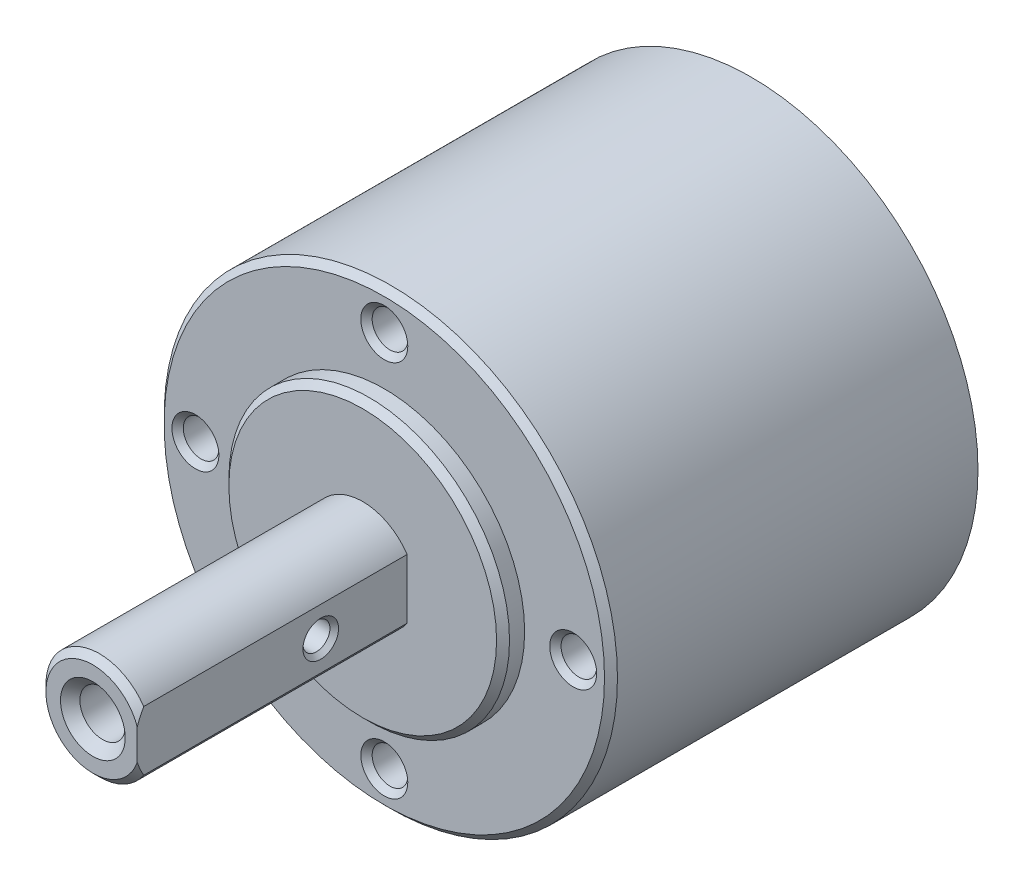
from build123d import *

# Parameters (mm, degrees)
SKETCH_1_R                   = 21
EXTRUDE_1_DEPTH              = 34
SKETCH_2_R                   = 13
EXTRUDE_2_DEPTH              = 2
SKETCH_4_R                   = 4.95
EXTRUDE_4_DEPTH              = 25
CUT_EXTRUDE_START            = -25
CUT_EXTRUDE_3_DEPTH          = 25
HOLE_WIZARD_M3_1_D           = 2.5
HOLE_WIZARD_M3_1_CSINK_D     = 3.3
HOLE_WIZARD_M3_1_CSINK_ANGLE = 90
CHAMFER_1_SIZE               = 0.6
HOLE_WIZARD_M4_1_D           = 3.3
HOLE_WIZARD_M4_1_DEPTH       = 11.5
HOLE_WIZARD_M4_1_CSINK_D     = 4.35
HOLE_WIZARD_M4_1_CSINK_ANGLE = 90
HOLE_WIZARD_M4_1_TIP         = 0.991420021


with BuildPart() as part:
    # Sketch 1 → Extrude 1 (new body)
    with BuildSketch(Plane.XY):
        Circle(SKETCH_1_R)
    extrude(amount=EXTRUDE_1_DEPTH)

    # Sketch 2 → Extrude 2 (add)
    with BuildSketch(Plane.XY.offset(34)):
        Circle(SKETCH_2_R)
    extrude(amount=EXTRUDE_2_DEPTH)

    # Sketch 4 → Extrude 4 (add)
    with BuildSketch(Plane.XY.offset(36)):
        Circle(SKETCH_4_R)
    extrude(amount=EXTRUDE_4_DEPTH)

    # Sketch 6 → Cut-Extrude 3 (cut)
    with BuildSketch(Plane.XY.offset(61).offset(CUT_EXTRUDE_START)):
        with BuildLine():
            Line((4.111110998, -2.757039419), (4.111110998, 2.757039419))
            ThreePointArc((4.111110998, 2.757039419), (4.95, 0), (4.111110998, -2.757039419))
        make_face()
    extrude(amount=CUT_EXTRUDE_3_DEPTH, mode=Mode.SUBTRACT)

    # Sketch 8 → Hole Wizard M5 _1 (revolve, cut)
    with BuildSketch(Plane(origin=(0, 0, 61), x_dir=(0, -1, 0), z_dir=(1, 0, 0))):
        Polygon((0, 0), (0, 15.2618073), (2.1, 14), (2.1, 0.9), (3, 0), align=None)
    revolve(axis=Axis((0, 0, 67.35), (0, 0, -1)), mode=Mode.SUBTRACT)

    # Hole Wizard M3 _1 (through all)
    with Locations(Plane(origin=(4.111110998, 0, 44), x_dir=(0, 0, 1), z_dir=(1, 0, 0))):
        with Locations((0, 0)):
            CounterSinkHole(HOLE_WIZARD_M3_1_D / 2, HOLE_WIZARD_M3_1_CSINK_D / 2, counter_sink_angle=HOLE_WIZARD_M3_1_CSINK_ANGLE)

    # Chamfer 1
    chamfer_1_edges = [part.edges().sort_by_distance(p)[0] for p in [
        (-4.95, 0, 61),
        (-21, 0, 34),
        (-13, 0, 36),
    ]]
    chamfer(chamfer_1_edges, length=CHAMFER_1_SIZE)

    # Hole Wizard M4 _1
    with Locations(Plane(origin=(0, 17.5, 34), x_dir=(1, 0, 0), z_dir=(0, 0, 1))):
        with Locations((0, 0), (0, -35), (-17.5, -17.5), (17.5, -17.5)):
            CounterSinkHole(HOLE_WIZARD_M4_1_D / 2, HOLE_WIZARD_M4_1_CSINK_D / 2, depth=HOLE_WIZARD_M4_1_DEPTH, counter_sink_angle=HOLE_WIZARD_M4_1_CSINK_ANGLE)
            with Locations((0, 0, -(HOLE_WIZARD_M4_1_DEPTH + HOLE_WIZARD_M4_1_TIP / 2))):  # 118° drill point
                Cone(0, HOLE_WIZARD_M4_1_D / 2, HOLE_WIZARD_M4_1_TIP, mode=Mode.SUBTRACT)


solid = part.part
